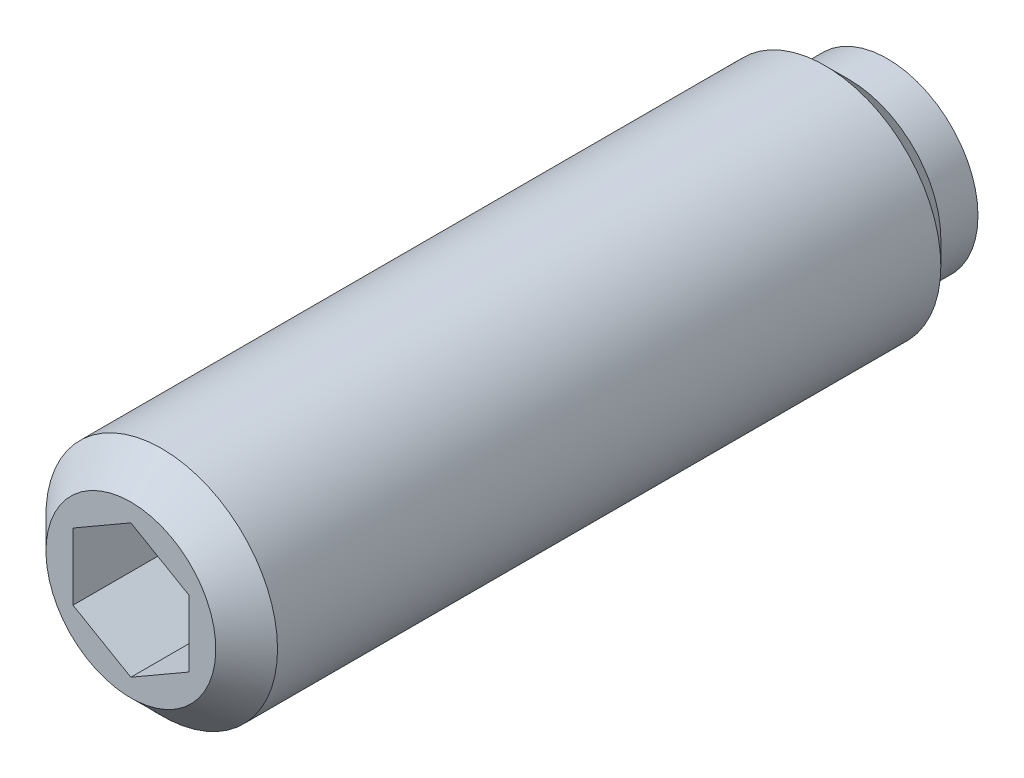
ISO-10303-21;
HEADER;
FILE_DESCRIPTION(('STEP AP214'),'2;1');
FILE_NAME('part.step','',(''),(''),'','','');
FILE_SCHEMA(('AUTOMOTIVE_DESIGN { 1 0 10303 214 1 1 1 1 }'));
ENDSEC;
DATA;
#1=APPLICATION_CONTEXT('core data for automotive mechanical design processes');
#2=APPLICATION_PROTOCOL_DEFINITION('international standard','automotive_design',2000,#1);
#3=PRODUCT_CONTEXT('',#1,'mechanical');
#4=PRODUCT('Part','Part','',(#3));
#5=PRODUCT_RELATED_PRODUCT_CATEGORY('part','',(#4));
#6=PRODUCT_DEFINITION_FORMATION('','',#4);
#7=PRODUCT_DEFINITION_CONTEXT('part definition',#1,'design');
#8=PRODUCT_DEFINITION('design','',#6,#7);
#9=PRODUCT_DEFINITION_SHAPE('','',#8);
#10=(LENGTH_UNIT() NAMED_UNIT(*) SI_UNIT(.MILLI.,.METRE.));
#11=(NAMED_UNIT(*) PLANE_ANGLE_UNIT() SI_UNIT($,.RADIAN.));
#12=(NAMED_UNIT(*) SI_UNIT($,.STERADIAN.) SOLID_ANGLE_UNIT());
#13=UNCERTAINTY_MEASURE_WITH_UNIT(LENGTH_MEASURE(1.E-05),#10,'distance_accuracy_value','');
#14=(GEOMETRIC_REPRESENTATION_CONTEXT(3) GLOBAL_UNCERTAINTY_ASSIGNED_CONTEXT((#13)) GLOBAL_UNIT_ASSIGNED_CONTEXT((#10,
#11,#12)) REPRESENTATION_CONTEXT('',''));
#15=CARTESIAN_POINT('',(0.,0.,0.));
#16=DIRECTION('',(0.,0.,1.));
#17=DIRECTION('',(1.,0.,0.));
#18=AXIS2_PLACEMENT_3D('',#15,#16,#17);
#19=CARTESIAN_POINT('',(1.5,-0.866025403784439,17.3));
#20=DIRECTION('',(-0.5,0.866025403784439,0.));
#21=DIRECTION('',(0.866025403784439,0.5,0.));
#22=AXIS2_PLACEMENT_3D('',#19,#20,#21);
#23=PLANE('',#22);
#24=DIRECTION('',(0.866025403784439,0.5,0.));
#25=VECTOR('',#24,1.);
#26=CARTESIAN_POINT('',(1.5,-0.866025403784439,17.3));
#27=LINE('',#26,#25);
#28=CARTESIAN_POINT('',(1.5,-0.866025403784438,17.3));
#29=VERTEX_POINT('',#28);
#30=CARTESIAN_POINT('',(0.,-1.73205080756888,17.3));
#31=VERTEX_POINT('',#30);
#32=EDGE_CURVE('E83',#29,#31,#27,.F.);
#33=ORIENTED_EDGE('',*,*,#32,.T.);
#34=DIRECTION('',(0.,0.,-1.));
#35=VECTOR('',#34,1.);
#36=CARTESIAN_POINT('',(0.,-1.73205080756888,17.3));
#37=LINE('',#36,#35);
#38=CARTESIAN_POINT('',(0.,-1.73205080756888,20.8));
#39=VERTEX_POINT('',#38);
#40=EDGE_CURVE('E81',#39,#31,#37,.T.);
#41=ORIENTED_EDGE('',*,*,#40,.F.);
#42=DIRECTION('',(0.866025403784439,0.5,0.));
#43=VECTOR('',#42,1.);
#44=CARTESIAN_POINT('',(1.5,-0.866025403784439,20.8));
#45=LINE('',#44,#43);
#46=CARTESIAN_POINT('',(1.5,-0.866025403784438,20.8));
#47=VERTEX_POINT('',#46);
#48=EDGE_CURVE('E67',#39,#47,#45,.T.);
#49=ORIENTED_EDGE('',*,*,#48,.T.);
#50=DIRECTION('',(0.,0.,1.));
#51=VECTOR('',#50,1.);
#52=CARTESIAN_POINT('',(1.5,-0.866025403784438,17.3));
#53=LINE('',#52,#51);
#54=EDGE_CURVE('E78',#29,#47,#53,.T.);
#55=ORIENTED_EDGE('',*,*,#54,.F.);
#56=EDGE_LOOP('',(#33,#41,#49,#55));
#57=FACE_BOUND('',#56,.T.);
#58=ADVANCED_FACE('F14',(#57),#23,.T.);
#59=CARTESIAN_POINT('',(0.,-1.73205080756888,17.3));
#60=DIRECTION('',(0.5,0.866025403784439,0.));
#61=DIRECTION('',(0.866025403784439,-0.5,0.));
#62=AXIS2_PLACEMENT_3D('',#59,#60,#61);
#63=PLANE('',#62);
#64=DIRECTION('',(-0.866025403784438,0.5,0.));
#65=VECTOR('',#64,1.);
#66=CARTESIAN_POINT('',(-0.75,-1.29903810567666,17.3));
#67=LINE('',#66,#65);
#68=CARTESIAN_POINT('',(-1.5,-0.866025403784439,17.3));
#69=VERTEX_POINT('',#68);
#70=EDGE_CURVE('E74',#31,#69,#67,.T.);
#71=ORIENTED_EDGE('',*,*,#70,.T.);
#72=DIRECTION('',(0.,0.,-1.));
#73=VECTOR('',#72,1.);
#74=CARTESIAN_POINT('',(-1.5,-0.866025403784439,17.3));
#75=LINE('',#74,#73);
#76=CARTESIAN_POINT('',(-1.5,-0.86602540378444,20.8));
#77=VERTEX_POINT('',#76);
#78=EDGE_CURVE('E90',#77,#69,#75,.T.);
#79=ORIENTED_EDGE('',*,*,#78,.F.);
#80=DIRECTION('',(0.866025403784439,-0.5,0.));
#81=VECTOR('',#80,1.);
#82=CARTESIAN_POINT('',(0.,-1.73205080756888,20.8));
#83=LINE('',#82,#81);
#84=EDGE_CURVE('E96',#77,#39,#83,.T.);
#85=ORIENTED_EDGE('',*,*,#84,.T.);
#86=ORIENTED_EDGE('',*,*,#40,.T.);
#87=EDGE_LOOP('',(#71,#79,#85,#86));
#88=FACE_BOUND('',#87,.T.);
#89=ADVANCED_FACE('F178',(#88),#63,.T.);
#90=CARTESIAN_POINT('',(1.5,0.866025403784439,17.3));
#91=DIRECTION('',(-1.,0.,0.));
#92=DIRECTION('',(0.,0.,1.));
#93=AXIS2_PLACEMENT_3D('',#90,#91,#92);
#94=PLANE('',#93);
#95=DIRECTION('',(0.,1.,0.));
#96=VECTOR('',#95,1.);
#97=CARTESIAN_POINT('',(1.5,0.866025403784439,17.3));
#98=LINE('',#97,#96);
#99=CARTESIAN_POINT('',(1.5,0.866025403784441,17.3));
#100=VERTEX_POINT('',#99);
#101=EDGE_CURVE('E73',#100,#29,#98,.F.);
#102=ORIENTED_EDGE('',*,*,#101,.T.);
#103=ORIENTED_EDGE('',*,*,#54,.T.);
#104=DIRECTION('',(0.,1.,0.));
#105=VECTOR('',#104,1.);
#106=CARTESIAN_POINT('',(1.5,0.866025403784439,20.8));
#107=LINE('',#106,#105);
#108=CARTESIAN_POINT('',(1.5,0.86602540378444,20.8));
#109=VERTEX_POINT('',#108);
#110=EDGE_CURVE('E63',#47,#109,#107,.T.);
#111=ORIENTED_EDGE('',*,*,#110,.T.);
#112=DIRECTION('',(0.,0.,-1.));
#113=VECTOR('',#112,1.);
#114=CARTESIAN_POINT('',(1.5,0.866025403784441,17.3));
#115=LINE('',#114,#113);
#116=EDGE_CURVE('E105',#100,#109,#115,.F.);
#117=ORIENTED_EDGE('',*,*,#116,.F.);
#118=EDGE_LOOP('',(#102,#103,#111,#117));
#119=FACE_BOUND('',#118,.T.);
#120=ADVANCED_FACE('F86',(#119),#94,.T.);
#121=CARTESIAN_POINT('',(-1.5,-0.866025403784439,17.3));
#122=DIRECTION('',(1.,0.,0.));
#123=DIRECTION('',(0.,0.,-1.));
#124=AXIS2_PLACEMENT_3D('',#121,#122,#123);
#125=PLANE('',#124);
#126=DIRECTION('',(0.,1.,0.));
#127=VECTOR('',#126,1.);
#128=CARTESIAN_POINT('',(-1.5,0.,17.3));
#129=LINE('',#128,#127);
#130=CARTESIAN_POINT('',(-1.5,0.866025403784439,17.3));
#131=VERTEX_POINT('',#130);
#132=EDGE_CURVE('E102',#69,#131,#129,.T.);
#133=ORIENTED_EDGE('',*,*,#132,.T.);
#134=DIRECTION('',(0.,0.,-1.));
#135=VECTOR('',#134,1.);
#136=CARTESIAN_POINT('',(-1.5,0.866025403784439,17.3));
#137=LINE('',#136,#135);
#138=CARTESIAN_POINT('',(-1.5,0.866025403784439,20.8));
#139=VERTEX_POINT('',#138);
#140=EDGE_CURVE('E107',#139,#131,#137,.T.);
#141=ORIENTED_EDGE('',*,*,#140,.F.);
#142=DIRECTION('',(0.,1.,0.));
#143=VECTOR('',#142,1.);
#144=CARTESIAN_POINT('',(-1.5,-0.866025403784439,20.8));
#145=LINE('',#144,#143);
#146=EDGE_CURVE('E87',#139,#77,#145,.F.);
#147=ORIENTED_EDGE('',*,*,#146,.T.);
#148=ORIENTED_EDGE('',*,*,#78,.T.);
#149=EDGE_LOOP('',(#133,#141,#147,#148));
#150=FACE_BOUND('',#149,.T.);
#151=ADVANCED_FACE('F185',(#150),#125,.T.);
#152=CARTESIAN_POINT('',(0.,0.,17.3));
#153=DIRECTION('',(0.,0.,-1.));
#154=DIRECTION('',(-1.,0.,0.));
#155=AXIS2_PLACEMENT_3D('',#152,#153,#154);
#156=PLANE('',#155);
#157=DIRECTION('',(-0.866025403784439,0.5,0.));
#158=VECTOR('',#157,1.);
#159=CARTESIAN_POINT('',(0.,1.73205080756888,17.3));
#160=LINE('',#159,#158);
#161=CARTESIAN_POINT('',(0.,1.73205080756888,17.3));
#162=VERTEX_POINT('',#161);
#163=EDGE_CURVE('E108',#162,#100,#160,.F.);
#164=ORIENTED_EDGE('',*,*,#163,.F.);
#165=DIRECTION('',(-0.866025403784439,-0.5,0.));
#166=VECTOR('',#165,1.);
#167=CARTESIAN_POINT('',(-1.5,0.866025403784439,17.3));
#168=LINE('',#167,#166);
#169=EDGE_CURVE('E117',#131,#162,#168,.F.);
#170=ORIENTED_EDGE('',*,*,#169,.F.);
#171=ORIENTED_EDGE('',*,*,#132,.F.);
#172=ORIENTED_EDGE('',*,*,#70,.F.);
#173=ORIENTED_EDGE('',*,*,#32,.F.);
#174=ORIENTED_EDGE('',*,*,#101,.F.);
#175=EDGE_LOOP('',(#164,#170,#171,#172,#173,#174));
#176=FACE_BOUND('',#175,.T.);
#177=ADVANCED_FACE('F190',(#176),#156,.F.);
#178=CARTESIAN_POINT('',(0.,1.73205080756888,17.3));
#179=DIRECTION('',(-0.5,-0.866025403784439,0.));
#180=DIRECTION('',(-0.866025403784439,0.5,0.));
#181=AXIS2_PLACEMENT_3D('',#178,#179,#180);
#182=PLANE('',#181);
#183=ORIENTED_EDGE('',*,*,#163,.T.);
#184=ORIENTED_EDGE('',*,*,#116,.T.);
#185=DIRECTION('',(-0.866025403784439,0.5,0.));
#186=VECTOR('',#185,1.);
#187=CARTESIAN_POINT('',(0.,1.73205080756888,20.8));
#188=LINE('',#187,#186);
#189=CARTESIAN_POINT('',(0.,1.73205080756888,20.8));
#190=VERTEX_POINT('',#189);
#191=EDGE_CURVE('E31',#109,#190,#188,.T.);
#192=ORIENTED_EDGE('',*,*,#191,.T.);
#193=DIRECTION('',(0.,0.,-1.));
#194=VECTOR('',#193,1.);
#195=CARTESIAN_POINT('',(0.,1.73205080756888,17.3));
#196=LINE('',#195,#194);
#197=EDGE_CURVE('E113',#162,#190,#196,.F.);
#198=ORIENTED_EDGE('',*,*,#197,.F.);
#199=EDGE_LOOP('',(#183,#184,#192,#198));
#200=FACE_BOUND('',#199,.T.);
#201=ADVANCED_FACE('F194',(#200),#182,.T.);
#202=CARTESIAN_POINT('',(-1.5,0.866025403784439,17.3));
#203=DIRECTION('',(0.5,-0.866025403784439,0.));
#204=DIRECTION('',(-0.866025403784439,-0.5,0.));
#205=AXIS2_PLACEMENT_3D('',#202,#203,#204);
#206=PLANE('',#205);
#207=ORIENTED_EDGE('',*,*,#169,.T.);
#208=ORIENTED_EDGE('',*,*,#197,.T.);
#209=DIRECTION('',(-0.866025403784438,-0.5,0.));
#210=VECTOR('',#209,1.);
#211=CARTESIAN_POINT('',(0.,1.73205080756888,20.8));
#212=LINE('',#211,#210);
#213=EDGE_CURVE('E111',#190,#139,#212,.T.);
#214=ORIENTED_EDGE('',*,*,#213,.T.);
#215=ORIENTED_EDGE('',*,*,#140,.T.);
#216=EDGE_LOOP('',(#207,#208,#214,#215));
#217=FACE_BOUND('',#216,.T.);
#218=ADVANCED_FACE('F198',(#217),#206,.T.);
#219=CARTESIAN_POINT('',(0.,0.,20.8));
#220=DIRECTION('',(0.,0.,-1.));
#221=DIRECTION('',(-1.,0.,0.));
#222=AXIS2_PLACEMENT_3D('',#219,#220,#221);
#223=PLANE('',#222);
#224=ORIENTED_EDGE('',*,*,#191,.F.);
#225=ORIENTED_EDGE('',*,*,#110,.F.);
#226=ORIENTED_EDGE('',*,*,#48,.F.);
#227=ORIENTED_EDGE('',*,*,#84,.F.);
#228=ORIENTED_EDGE('',*,*,#146,.F.);
#229=ORIENTED_EDGE('',*,*,#213,.F.);
#230=EDGE_LOOP('',(#224,#225,#226,#227,#228,#229));
#231=FACE_BOUND('',#230,.T.);
#232=CARTESIAN_POINT('',(0.,0.,20.8));
#233=DIRECTION('',(0.,0.,-1.));
#234=DIRECTION('',(0.,1.,0.));
#235=AXIS2_PLACEMENT_3D('',#232,#233,#234);
#236=CIRCLE('',#235,2.20000000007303);
#237=CARTESIAN_POINT('',(0.,2.20000000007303,20.8));
#238=VERTEX_POINT('',#237);
#239=EDGE_CURVE('E17',#238,#238,#236,.T.);
#240=ORIENTED_EDGE('',*,*,#239,.F.);
#241=EDGE_LOOP('',(#240));
#242=FACE_BOUND('',#241,.T.);
#243=ADVANCED_FACE('F65',(#231,#242),#223,.F.);
#244=CARTESIAN_POINT('',(0.,0.,20.0000000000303));
#245=DIRECTION('',(0.,0.,-1.));
#246=DIRECTION('',(0.,1.,0.));
#247=AXIS2_PLACEMENT_3D('',#244,#245,#246);
#248=CONICAL_SURFACE('',#247,3.00000000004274,0.785398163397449);
#249=ORIENTED_EDGE('',*,*,#239,.T.);
#250=EDGE_LOOP('',(#249));
#251=FACE_BOUND('',#250,.T.);
#252=CARTESIAN_POINT('',(0.,0.,20.));
#253=DIRECTION('',(0.,0.,1.));
#254=DIRECTION('',(1.,0.,0.));
#255=AXIS2_PLACEMENT_3D('',#252,#253,#254);
#256=CIRCLE('',#255,3.);
#257=CARTESIAN_POINT('',(3.,0.,20.));
#258=VERTEX_POINT('',#257);
#259=EDGE_CURVE('E9',#258,#258,#256,.F.);
#260=ORIENTED_EDGE('',*,*,#259,.F.);
#261=EDGE_LOOP('',(#260));
#262=FACE_BOUND('',#261,.T.);
#263=ADVANCED_FACE('F174',(#251,#262),#248,.T.);
#264=CARTESIAN_POINT('',(0.,0.,11.2));
#265=DIRECTION('',(0.,0.,1.));
#266=DIRECTION('',(1.,0.,0.));
#267=AXIS2_PLACEMENT_3D('',#264,#265,#266);
#268=CYLINDRICAL_SURFACE('',#267,3.);
#269=ORIENTED_EDGE('',*,*,#259,.T.);
#270=EDGE_LOOP('',(#269));
#271=FACE_BOUND('',#270,.T.);
#272=CARTESIAN_POINT('',(0.,0.,2.81349999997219));
#273=DIRECTION('',(0.,0.,1.));
#274=DIRECTION('',(1.,0.,0.));
#275=AXIS2_PLACEMENT_3D('',#272,#273,#274);
#276=CIRCLE('',#275,3.);
#277=CARTESIAN_POINT('',(3.,0.,2.81349999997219));
#278=VERTEX_POINT('',#277);
#279=EDGE_CURVE('E137',#278,#278,#276,.T.);
#280=ORIENTED_EDGE('',*,*,#279,.T.);
#281=EDGE_LOOP('',(#280));
#282=FACE_BOUND('',#281,.T.);
#283=ADVANCED_FACE('F141',(#271,#282),#268,.T.);
#284=CARTESIAN_POINT('',(0.,-2.9091746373E-11,2.));
#285=DIRECTION('',(0.,0.,1.));
#286=DIRECTION('',(0.,-1.,0.));
#287=AXIS2_PLACEMENT_3D('',#284,#285,#286);
#288=SPHERICAL_SURFACE('',#287,2.);
#289=CARTESIAN_POINT('',(0.,0.,1.2));
#290=DIRECTION('',(0.,0.,1.));
#291=DIRECTION('',(1.,0.,0.));
#292=AXIS2_PLACEMENT_3D('',#289,#290,#291);
#293=CIRCLE('',#292,1.83303027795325);
#294=CARTESIAN_POINT('',(1.83303027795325,0.,1.2));
#295=VERTEX_POINT('',#294);
#296=EDGE_CURVE('E84',#295,#295,#293,.T.);
#297=ORIENTED_EDGE('',*,*,#296,.F.);
#298=EDGE_LOOP('',(#297));
#299=FACE_BOUND('',#298,.T.);
#300=ADVANCED_FACE('F164',(#299),#288,.T.);
#301=CARTESIAN_POINT('',(0.,1.83303027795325,1.2));
#302=DIRECTION('',(0.,0.,1.));
#303=DIRECTION('',(1.,0.,0.));
#304=AXIS2_PLACEMENT_3D('',#301,#302,#303);
#305=PLANE('',#304);
#306=CARTESIAN_POINT('',(0.,0.,1.2));
#307=DIRECTION('',(0.,0.,1.));
#308=DIRECTION('',(1.,0.,0.));
#309=AXIS2_PLACEMENT_3D('',#306,#307,#308);
#310=CIRCLE('',#309,2.34999999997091);
#311=CARTESIAN_POINT('',(2.34999999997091,0.,1.2));
#312=VERTEX_POINT('',#311);
#313=EDGE_CURVE('E128',#312,#312,#310,.T.);
#314=ORIENTED_EDGE('',*,*,#313,.F.);
#315=EDGE_LOOP('',(#314));
#316=FACE_BOUND('',#315,.T.);
#317=ORIENTED_EDGE('',*,*,#296,.T.);
#318=EDGE_LOOP('',(#317));
#319=FACE_BOUND('',#318,.T.);
#320=ADVANCED_FACE('F158',(#316,#319),#305,.F.);
#321=CARTESIAN_POINT('',(0.,0.,21.6108925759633));
#322=DIRECTION('',(0.,0.,1.));
#323=DIRECTION('',(1.,0.,0.));
#324=AXIS2_PLACEMENT_3D('',#321,#322,#323);
#325=CYLINDRICAL_SURFACE('',#324,2.34999999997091);
#326=CARTESIAN_POINT('',(0.,0.,2.2));
#327=DIRECTION('',(0.,0.,1.));
#328=DIRECTION('',(1.,0.,0.));
#329=AXIS2_PLACEMENT_3D('',#326,#327,#328);
#330=CIRCLE('',#329,2.34999999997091);
#331=CARTESIAN_POINT('',(2.34999999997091,0.,2.2));
#332=VERTEX_POINT('',#331);
#333=EDGE_CURVE('E131',#332,#332,#330,.T.);
#334=ORIENTED_EDGE('',*,*,#333,.F.);
#335=EDGE_LOOP('',(#334));
#336=FACE_BOUND('',#335,.T.);
#337=ORIENTED_EDGE('',*,*,#313,.T.);
#338=EDGE_LOOP('',(#337));
#339=FACE_BOUND('',#338,.T.);
#340=ADVANCED_FACE('F152',(#336,#339),#325,.T.);
#341=CARTESIAN_POINT('',(0.,2.34999999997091,2.2));
#342=DIRECTION('',(0.,0.,1.));
#343=DIRECTION('',(1.,0.,0.));
#344=AXIS2_PLACEMENT_3D('',#341,#342,#343);
#345=PLANE('',#344);
#346=CARTESIAN_POINT('',(0.,0.,2.2));
#347=DIRECTION('',(0.,0.,1.));
#348=DIRECTION('',(1.,0.,0.));
#349=AXIS2_PLACEMENT_3D('',#346,#347,#348);
#350=CIRCLE('',#349,2.38650000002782);
#351=CARTESIAN_POINT('',(2.38650000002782,0.,2.2));
#352=VERTEX_POINT('',#351);
#353=EDGE_CURVE('E134',#352,#352,#350,.T.);
#354=ORIENTED_EDGE('',*,*,#353,.F.);
#355=EDGE_LOOP('',(#354));
#356=FACE_BOUND('',#355,.T.);
#357=ORIENTED_EDGE('',*,*,#333,.T.);
#358=EDGE_LOOP('',(#357));
#359=FACE_BOUND('',#358,.T.);
#360=ADVANCED_FACE('F146',(#356,#359),#345,.F.);
#361=CARTESIAN_POINT('',(0.,0.,2.2));
#362=DIRECTION('',(0.,0.,1.));
#363=DIRECTION('',(1.,0.,0.));
#364=AXIS2_PLACEMENT_3D('',#361,#362,#363);
#365=CONICAL_SURFACE('',#364,2.38650000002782,0.78539816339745);
#366=ORIENTED_EDGE('',*,*,#279,.F.);
#367=EDGE_LOOP('',(#366));
#368=FACE_BOUND('',#367,.T.);
#369=ORIENTED_EDGE('',*,*,#353,.T.);
#370=EDGE_LOOP('',(#369));
#371=FACE_BOUND('',#370,.T.);
#372=ADVANCED_FACE('F143',(#368,#371),#365,.T.);
#373=CLOSED_SHELL('',(#58,#89,#120,#151,#177,#201,#218,#243,#263,#283,#300,#320,#340,#360,#372));
#374=MANIFOLD_SOLID_BREP('B1',#373);
#375=ADVANCED_BREP_SHAPE_REPRESENTATION('',(#18,#374),#14);
#376=SHAPE_DEFINITION_REPRESENTATION(#9,#375);
ENDSEC;
END-ISO-10303-21;
